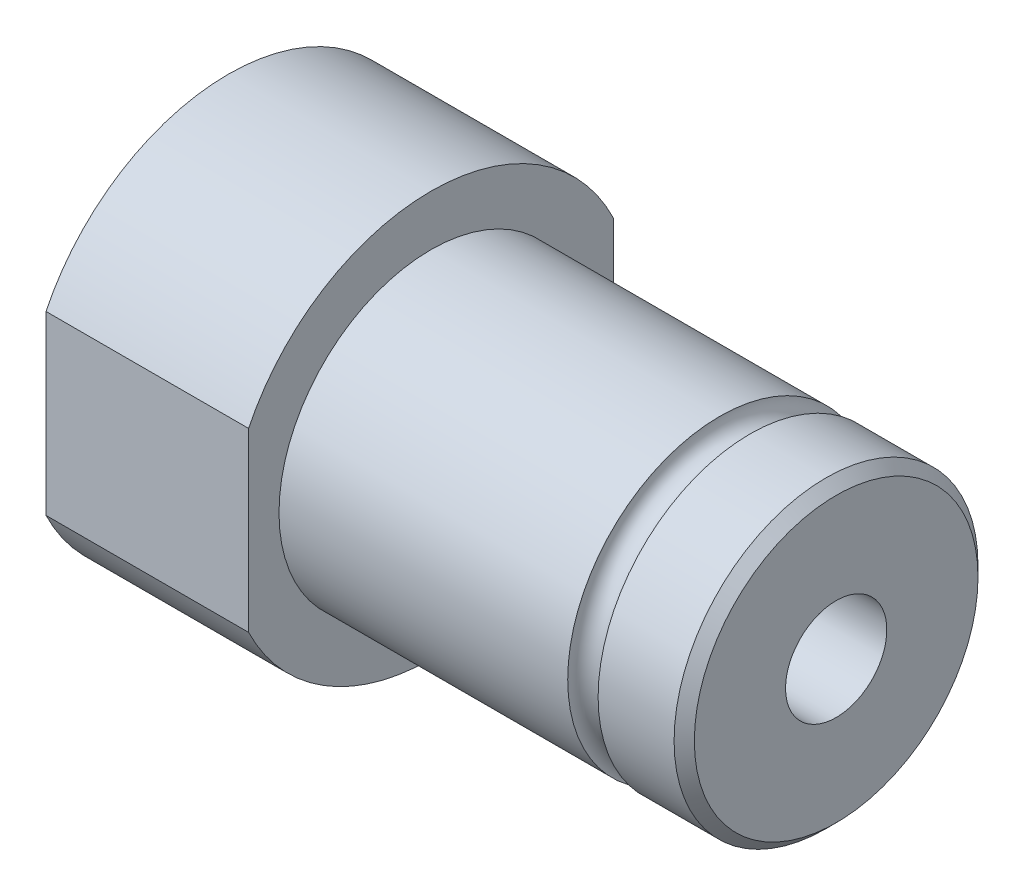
from build123d import *

# Parameters (mm, degrees)
SKETCH_1_R          = 20
EXTRUDE_1_DEPTH     = 60
SKETCH_2_R          = 5
CUT_EXTRUDE_1_DEPTH = 67.332495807
SKETCH_3_OUTSIDE_W  = 58.492
SKETCH_3_OUTSIDE_H  = 58.492
SKETCH_3_OUTSIDE_R  = 15
CUT_EXTRUDE_2_DEPTH = 40
SKETCH_4_OUTSIDE_W  = 58.492
SKETCH_4_OUTSIDE_H  = 58.492
CUT_EXTRUDE_3_DEPTH = 67.332495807
SKETCH_5_R          = 1.5
CHAMFER_1_SIZE      = 1


with BuildPart() as part:
    # Sketch 1 → Extrude 1 (new body)
    with BuildSketch(Plane(origin=(0, 0, 0), x_dir=(0, 0, -1), z_dir=(1, 0, 0))):
        Circle(SKETCH_1_R)
    extrude(amount=EXTRUDE_1_DEPTH)

    # Sketch 2 → Cut-Extrude 1 (cut, through all)
    with BuildSketch(Plane.ZY):
        Circle(SKETCH_2_R)
    extrude(amount=-CUT_EXTRUDE_1_DEPTH, mode=Mode.SUBTRACT)

    # Sketch 3 outside → Cut-Extrude 2 (cut)
    with BuildSketch(Plane(origin=(60, 0, 0), x_dir=(0, 0, -1), z_dir=(1, 0, 0))):
        Rectangle(SKETCH_3_OUTSIDE_W, SKETCH_3_OUTSIDE_H)
        Circle(SKETCH_3_OUTSIDE_R, mode=Mode.SUBTRACT)
    extrude(amount=-CUT_EXTRUDE_2_DEPTH, mode=Mode.SUBTRACT)

    # Sketch 4 outside → Cut-Extrude 3 (cut, through all)
    with BuildSketch(Plane.ZY):
        Rectangle(SKETCH_4_OUTSIDE_W, SKETCH_4_OUTSIDE_H)
        with BuildLine():
            Line((-18, -8.717797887), (-18, 8.717797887))
            ThreePointArc((-18, 8.717797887), (0, 20), (18, 8.717797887))
            Line((18, 8.717797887), (18, -8.717797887))
            ThreePointArc((18, -8.717797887), (0, -20), (-18, -8.717797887))
        make_face(mode=Mode.SUBTRACT)
    extrude(amount=-CUT_EXTRUDE_3_DEPTH, mode=Mode.SUBTRACT)

    # Sketch 5 → Cut-Revolve 1 (revolve, cut)
    with BuildSketch(Plane.XY, mode=Mode.PRIVATE) as cut_revolve_1_sk:
        with Locations((50, 15)):
            Circle(SKETCH_5_R)
    revolve(cut_revolve_1_sk.sketch.rotate(Axis((0, 0, 0), (1, 0, 0)), 270), axis=Axis((0, 0, 0), (1, 0, 0)), mode=Mode.SUBTRACT)

    # Chamfer 1
    chamfer_1_edges = [part.edges().sort_by_distance(p)[0] for p in [
        (60, 0, 15),
    ]]
    chamfer(chamfer_1_edges, length=CHAMFER_1_SIZE)


solid = part.part
